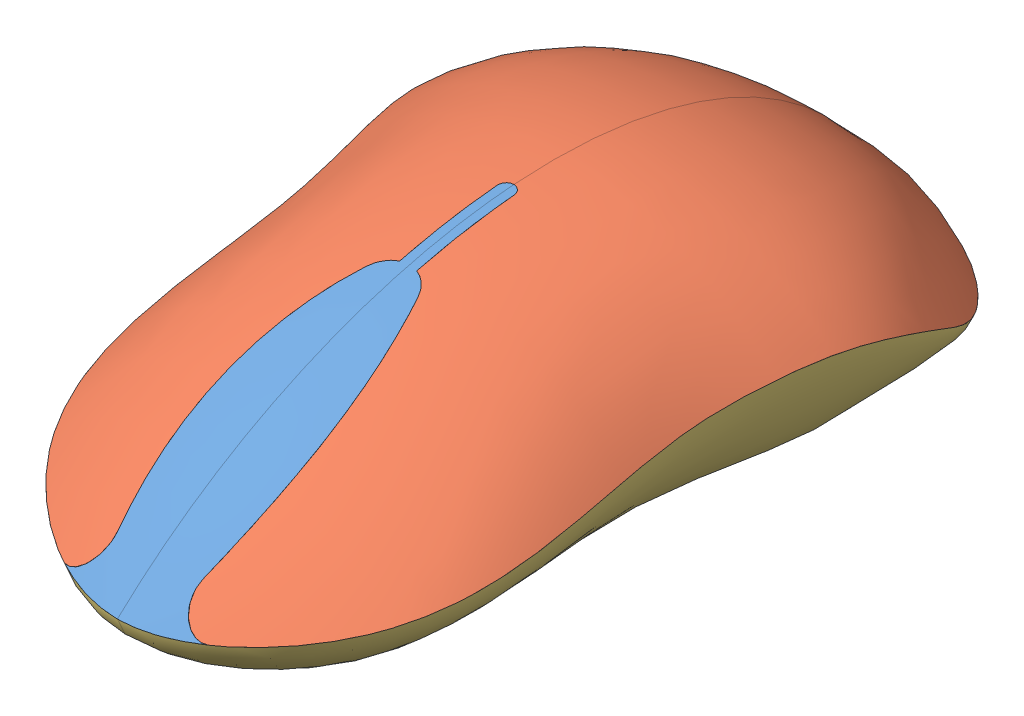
SolidWorks assembly Mouse_Assembly_&.SLDASM, configuration Default (file format 14000). Lengths in mm.
Overall size (85.9 51.27 140.59).
3 component instances, 3 part files, 0 mates.
Components (placement in the parent):
- Wheel_Mount_&-1: Wheel_Mount_&.SLDPRT [Default] at origin size (49.39 36.69 73.33)
- Top_Cover_&-1: Top_Cover_&.SLDPRT [Default] at origin size (85.9 51.27 138.59)
- Bottom_&-1: Bottom_&.SLDPRT [Default] at origin size (85.9 26.16 140.59)
